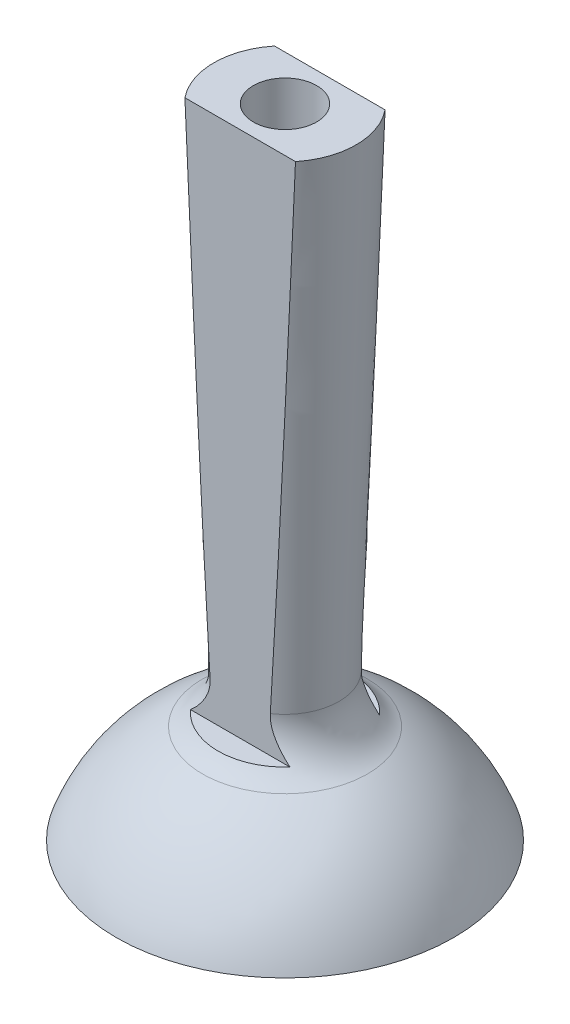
from build123d import *

# Parameters (mm, degrees)
FILLET_2_R          = 10
CUT_EXTRUDE_1_DEPTH = 100


with BuildPart() as part:
    # Sketch 1 → Revolve 1 (revolve)
    with BuildSketch(Plane.XY):
        with BuildLine():
            Line((-13.5, 90), (-10, -10))
            ThreePointArc((-10, -10), (-23.478713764, -17.903252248), (-32, -31))
            Line((-32, -31), (-27, -31))
            Line((-27, -31), (-26.984516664, -31))
            Line((-26.984516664, -31), (0, -31))
            Line((0, -31), (0, -28))
            Line((0, -28), (-6, -28))
            Line((-6, -28), (-6, -13.787387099))
            Line((-6, -13.787387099), (-6, -8.937387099))
            Line((-6, -8.937387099), (-6, 90))
            Line((-6, 90), (-13.5, 90))
        make_face()
    revolve(axis=Axis((0, 0, 0), (0, 1, 0)))

    # Fillet 2
    fillet_2_edges = [part.edges().sort_by_distance(p)[0] for p in [
        (10, -10, 0),
    ]]
    fillet(fillet_2_edges, radius=FILLET_2_R)

    # Sketch 2 → Cut-Extrude 1 (cut)
    with BuildSketch(Plane(origin=(0, 90, 0), x_dir=(1, 0, 0), z_dir=(0, 1, 0))):
        Polygon((0, 8.5), (19.613925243, 8.5), (19.613925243, 16.0190684), (-21.403743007, 16.0190684), (-21.403743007, 8.5), align=None)
        Polygon((-21.403743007, -16.0190684), (-21.403743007, -8.5), (0, -8.5), (19.613925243, -8.5), (19.613925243, -16.0190684), align=None)
    extrude(amount=-CUT_EXTRUDE_1_DEPTH, mode=Mode.SUBTRACT)


solid = part.part
